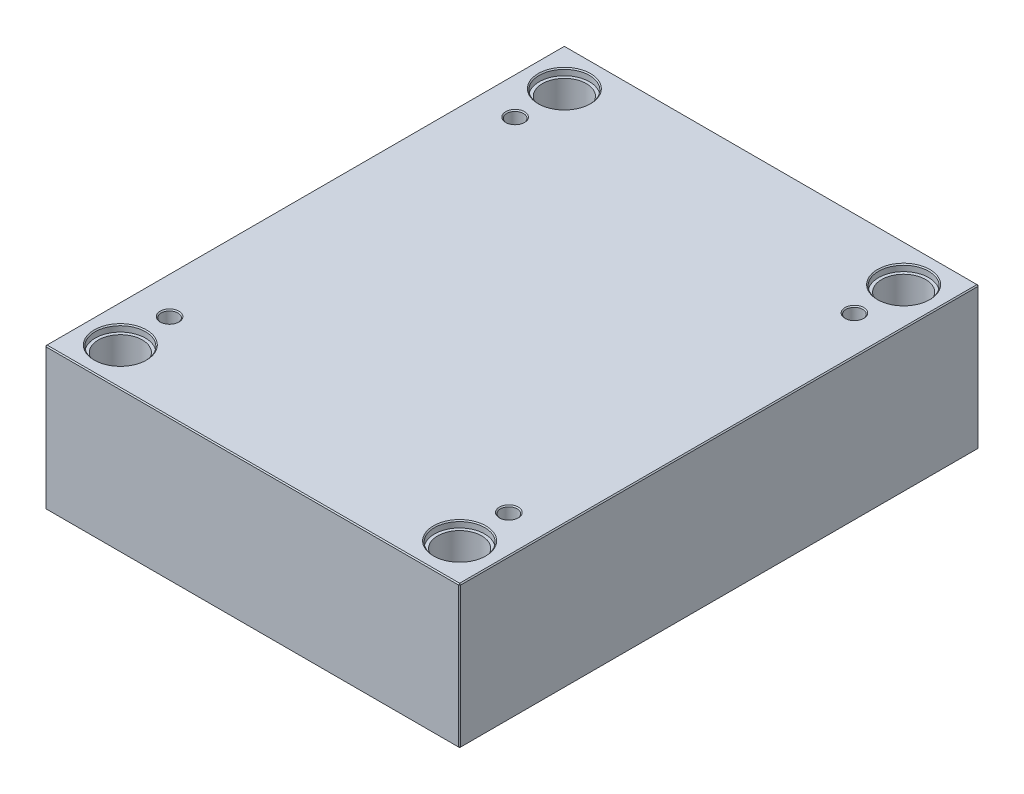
ISO-10303-21;
HEADER;
FILE_DESCRIPTION(('STEP AP214'),'2;1');
FILE_NAME('part.step','',(''),(''),'','','');
FILE_SCHEMA(('AUTOMOTIVE_DESIGN { 1 0 10303 214 1 1 1 1 }'));
ENDSEC;
DATA;
#1=APPLICATION_CONTEXT('core data for automotive mechanical design processes');
#2=APPLICATION_PROTOCOL_DEFINITION('international standard','automotive_design',2000,#1);
#3=PRODUCT_CONTEXT('',#1,'mechanical');
#4=PRODUCT('Part','Part','',(#3));
#5=PRODUCT_RELATED_PRODUCT_CATEGORY('part','',(#4));
#6=PRODUCT_DEFINITION_FORMATION('','',#4);
#7=PRODUCT_DEFINITION_CONTEXT('part definition',#1,'design');
#8=PRODUCT_DEFINITION('design','',#6,#7);
#9=PRODUCT_DEFINITION_SHAPE('','',#8);
#10=(LENGTH_UNIT() NAMED_UNIT(*) SI_UNIT(.MILLI.,.METRE.));
#11=(NAMED_UNIT(*) PLANE_ANGLE_UNIT() SI_UNIT($,.RADIAN.));
#12=(NAMED_UNIT(*) SI_UNIT($,.STERADIAN.) SOLID_ANGLE_UNIT());
#13=UNCERTAINTY_MEASURE_WITH_UNIT(LENGTH_MEASURE(1.E-05),#10,'distance_accuracy_value','');
#14=(GEOMETRIC_REPRESENTATION_CONTEXT(3) GLOBAL_UNCERTAINTY_ASSIGNED_CONTEXT((#13)) GLOBAL_UNIT_ASSIGNED_CONTEXT((#10,
#11,#12)) REPRESENTATION_CONTEXT('',''));
#15=CARTESIAN_POINT('',(0.,0.,0.));
#16=DIRECTION('',(0.,0.,1.));
#17=DIRECTION('',(1.,0.,0.));
#18=AXIS2_PLACEMENT_3D('',#15,#16,#17);
#19=CARTESIAN_POINT('',(-162.,0.,-212.));
#20=DIRECTION('',(0.,1.,0.));
#21=DIRECTION('',(0.,0.,1.));
#22=AXIS2_PLACEMENT_3D('',#19,#20,#21);
#23=CYLINDRICAL_SURFACE('',#22,21.);
#24=CARTESIAN_POINT('',(-162.,1.00000000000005,-212.));
#25=DIRECTION('',(0.,1.,0.));
#26=DIRECTION('',(0.,0.,1.));
#27=AXIS2_PLACEMENT_3D('',#24,#25,#26);
#28=CIRCLE('',#27,21.);
#29=CARTESIAN_POINT('',(-162.,1.00000000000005,-191.));
#30=VERTEX_POINT('',#29);
#31=EDGE_CURVE('E472',#30,#30,#28,.F.);
#32=ORIENTED_EDGE('',*,*,#31,.T.);
#33=EDGE_LOOP('',(#32));
#34=FACE_BOUND('',#33,.T.);
#35=CARTESIAN_POINT('',(-162.,129.7,-212.));
#36=DIRECTION('',(0.,1.,0.));
#37=DIRECTION('',(0.,0.,1.));
#38=AXIS2_PLACEMENT_3D('',#35,#36,#37);
#39=CIRCLE('',#38,21.);
#40=CARTESIAN_POINT('',(-162.,129.7,-191.));
#41=VERTEX_POINT('',#40);
#42=EDGE_CURVE('E221',#41,#41,#39,.F.);
#43=ORIENTED_EDGE('',*,*,#42,.F.);
#44=EDGE_LOOP('',(#43));
#45=FACE_BOUND('',#44,.T.);
#46=ADVANCED_FACE('F16',(#34,#45),#23,.F.);
#47=CARTESIAN_POINT('',(162.,0.,-212.));
#48=DIRECTION('',(0.,1.,0.));
#49=DIRECTION('',(0.,0.,1.));
#50=AXIS2_PLACEMENT_3D('',#47,#48,#49);
#51=CYLINDRICAL_SURFACE('',#50,21.);
#52=CARTESIAN_POINT('',(162.,1.00000000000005,-212.));
#53=DIRECTION('',(0.,1.,0.));
#54=DIRECTION('',(0.,0.,1.));
#55=AXIS2_PLACEMENT_3D('',#52,#53,#54);
#56=CIRCLE('',#55,21.);
#57=CARTESIAN_POINT('',(162.,1.00000000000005,-191.));
#58=VERTEX_POINT('',#57);
#59=EDGE_CURVE('E474',#58,#58,#56,.F.);
#60=ORIENTED_EDGE('',*,*,#59,.T.);
#61=EDGE_LOOP('',(#60));
#62=FACE_BOUND('',#61,.T.);
#63=CARTESIAN_POINT('',(162.,129.7,-212.));
#64=DIRECTION('',(0.,1.,0.));
#65=DIRECTION('',(0.,0.,1.));
#66=AXIS2_PLACEMENT_3D('',#63,#64,#65);
#67=CIRCLE('',#66,21.);
#68=CARTESIAN_POINT('',(162.,129.7,-191.));
#69=VERTEX_POINT('',#68);
#70=EDGE_CURVE('E218',#69,#69,#67,.F.);
#71=ORIENTED_EDGE('',*,*,#70,.F.);
#72=EDGE_LOOP('',(#71));
#73=FACE_BOUND('',#72,.T.);
#74=ADVANCED_FACE('F263',(#62,#73),#51,.F.);
#75=CARTESIAN_POINT('',(162.,0.,212.));
#76=DIRECTION('',(0.,1.,0.));
#77=DIRECTION('',(0.,0.,1.));
#78=AXIS2_PLACEMENT_3D('',#75,#76,#77);
#79=CYLINDRICAL_SURFACE('',#78,21.);
#80=CARTESIAN_POINT('',(162.,0.999999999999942,212.));
#81=DIRECTION('',(0.,1.,0.));
#82=DIRECTION('',(0.,0.,1.));
#83=AXIS2_PLACEMENT_3D('',#80,#81,#82);
#84=CIRCLE('',#83,21.);
#85=CARTESIAN_POINT('',(162.,0.999999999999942,233.));
#86=VERTEX_POINT('',#85);
#87=EDGE_CURVE('E477',#86,#86,#84,.F.);
#88=ORIENTED_EDGE('',*,*,#87,.T.);
#89=EDGE_LOOP('',(#88));
#90=FACE_BOUND('',#89,.T.);
#91=CARTESIAN_POINT('',(162.,129.7,212.));
#92=DIRECTION('',(0.,1.,0.));
#93=DIRECTION('',(0.,0.,1.));
#94=AXIS2_PLACEMENT_3D('',#91,#92,#93);
#95=CIRCLE('',#94,21.);
#96=CARTESIAN_POINT('',(162.,129.7,233.));
#97=VERTEX_POINT('',#96);
#98=EDGE_CURVE('E214',#97,#97,#95,.F.);
#99=ORIENTED_EDGE('',*,*,#98,.F.);
#100=EDGE_LOOP('',(#99));
#101=FACE_BOUND('',#100,.T.);
#102=ADVANCED_FACE('F270',(#90,#101),#79,.F.);
#103=CARTESIAN_POINT('',(-162.,0.,212.));
#104=DIRECTION('',(0.,1.,0.));
#105=DIRECTION('',(0.,0.,1.));
#106=AXIS2_PLACEMENT_3D('',#103,#104,#105);
#107=CYLINDRICAL_SURFACE('',#106,21.);
#108=CARTESIAN_POINT('',(-162.,1.00000000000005,212.));
#109=DIRECTION('',(0.,1.,0.));
#110=DIRECTION('',(0.,0.,1.));
#111=AXIS2_PLACEMENT_3D('',#108,#109,#110);
#112=CIRCLE('',#111,21.);
#113=CARTESIAN_POINT('',(-162.,1.00000000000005,233.));
#114=VERTEX_POINT('',#113);
#115=EDGE_CURVE('E480',#114,#114,#112,.F.);
#116=ORIENTED_EDGE('',*,*,#115,.T.);
#117=EDGE_LOOP('',(#116));
#118=FACE_BOUND('',#117,.T.);
#119=CARTESIAN_POINT('',(-162.,129.7,212.));
#120=DIRECTION('',(0.,1.,0.));
#121=DIRECTION('',(0.,0.,1.));
#122=AXIS2_PLACEMENT_3D('',#119,#120,#121);
#123=CIRCLE('',#122,21.);
#124=CARTESIAN_POINT('',(-162.,129.7,233.));
#125=VERTEX_POINT('',#124);
#126=EDGE_CURVE('E211',#125,#125,#123,.F.);
#127=ORIENTED_EDGE('',*,*,#126,.F.);
#128=EDGE_LOOP('',(#127));
#129=FACE_BOUND('',#128,.T.);
#130=ADVANCED_FACE('F277',(#118,#129),#107,.F.);
#131=CARTESIAN_POINT('',(-198.,136.,248.));
#132=DIRECTION('',(1.,0.,0.));
#133=DIRECTION('',(0.,0.,-1.));
#134=AXIS2_PLACEMENT_3D('',#131,#132,#133);
#135=PLANE('',#134);
#136=DIRECTION('',(0.,-1.,0.));
#137=VECTOR('',#136,1.);
#138=CARTESIAN_POINT('',(-198.,136.,-247.));
#139=LINE('',#138,#137);
#140=CARTESIAN_POINT('',(-198.,135.,-247.));
#141=VERTEX_POINT('',#140);
#142=CARTESIAN_POINT('',(-198.,1.00000000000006,-247.));
#143=VERTEX_POINT('',#142);
#144=EDGE_CURVE('E487',#141,#143,#139,.T.);
#145=ORIENTED_EDGE('',*,*,#144,.T.);
#146=DIRECTION('',(0.,0.,1.));
#147=VECTOR('',#146,1.);
#148=CARTESIAN_POINT('',(-198.,1.00000000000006,248.));
#149=LINE('',#148,#147);
#150=CARTESIAN_POINT('',(-198.,1.00000000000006,247.));
#151=VERTEX_POINT('',#150);
#152=EDGE_CURVE('E490',#143,#151,#149,.T.);
#153=ORIENTED_EDGE('',*,*,#152,.T.);
#154=DIRECTION('',(0.,1.,0.));
#155=VECTOR('',#154,1.);
#156=CARTESIAN_POINT('',(-198.,136.,247.));
#157=LINE('',#156,#155);
#158=CARTESIAN_POINT('',(-198.,135.,247.));
#159=VERTEX_POINT('',#158);
#160=EDGE_CURVE('E485',#151,#159,#157,.T.);
#161=ORIENTED_EDGE('',*,*,#160,.T.);
#162=DIRECTION('',(0.,0.,-1.));
#163=VECTOR('',#162,1.);
#164=CARTESIAN_POINT('',(-198.,135.,-248.));
#165=LINE('',#164,#163);
#166=EDGE_CURVE('E483',#159,#141,#165,.T.);
#167=ORIENTED_EDGE('',*,*,#166,.T.);
#168=EDGE_LOOP('',(#145,#153,#161,#167));
#169=FACE_BOUND('',#168,.T.);
#170=ADVANCED_FACE('F298',(#169),#135,.F.);
#171=CARTESIAN_POINT('',(198.,136.,248.));
#172=DIRECTION('',(0.,0.,-1.));
#173=DIRECTION('',(-1.,0.,0.));
#174=AXIS2_PLACEMENT_3D('',#171,#172,#173);
#175=PLANE('',#174);
#176=DIRECTION('',(-1.,0.,0.));
#177=VECTOR('',#176,1.);
#178=CARTESIAN_POINT('',(-198.,135.,248.));
#179=LINE('',#178,#177);
#180=CARTESIAN_POINT('',(197.,135.,248.));
#181=VERTEX_POINT('',#180);
#182=CARTESIAN_POINT('',(-197.,135.,248.));
#183=VERTEX_POINT('',#182);
#184=EDGE_CURVE('E509',#181,#183,#179,.T.);
#185=ORIENTED_EDGE('',*,*,#184,.T.);
#186=DIRECTION('',(0.,-1.,0.));
#187=VECTOR('',#186,1.);
#188=CARTESIAN_POINT('',(-197.,136.,248.));
#189=LINE('',#188,#187);
#190=CARTESIAN_POINT('',(-197.,1.,248.));
#191=VERTEX_POINT('',#190);
#192=EDGE_CURVE('E515',#183,#191,#189,.T.);
#193=ORIENTED_EDGE('',*,*,#192,.T.);
#194=DIRECTION('',(1.,0.,0.));
#195=VECTOR('',#194,1.);
#196=CARTESIAN_POINT('',(198.,1.,248.));
#197=LINE('',#196,#195);
#198=CARTESIAN_POINT('',(197.,1.,248.));
#199=VERTEX_POINT('',#198);
#200=EDGE_CURVE('E513',#191,#199,#197,.T.);
#201=ORIENTED_EDGE('',*,*,#200,.T.);
#202=DIRECTION('',(0.,1.,0.));
#203=VECTOR('',#202,1.);
#204=CARTESIAN_POINT('',(197.,136.,248.));
#205=LINE('',#204,#203);
#206=EDGE_CURVE('E511',#199,#181,#205,.T.);
#207=ORIENTED_EDGE('',*,*,#206,.T.);
#208=EDGE_LOOP('',(#185,#193,#201,#207));
#209=FACE_BOUND('',#208,.T.);
#210=ADVANCED_FACE('F294',(#209),#175,.F.);
#211=CARTESIAN_POINT('',(198.,136.,248.));
#212=DIRECTION('',(-1.,0.,0.));
#213=DIRECTION('',(0.,0.,1.));
#214=AXIS2_PLACEMENT_3D('',#211,#212,#213);
#215=PLANE('',#214);
#216=DIRECTION('',(0.,0.,-1.));
#217=VECTOR('',#216,1.);
#218=CARTESIAN_POINT('',(198.,1.,248.));
#219=LINE('',#218,#217);
#220=CARTESIAN_POINT('',(198.,1.,247.));
#221=VERTEX_POINT('',#220);
#222=CARTESIAN_POINT('',(198.,1.,-247.));
#223=VERTEX_POINT('',#222);
#224=EDGE_CURVE('E504',#221,#223,#219,.T.);
#225=ORIENTED_EDGE('',*,*,#224,.T.);
#226=DIRECTION('',(0.,1.,0.));
#227=VECTOR('',#226,1.);
#228=CARTESIAN_POINT('',(198.,136.,-247.));
#229=LINE('',#228,#227);
#230=CARTESIAN_POINT('',(198.,135.,-247.));
#231=VERTEX_POINT('',#230);
#232=EDGE_CURVE('E506',#223,#231,#229,.T.);
#233=ORIENTED_EDGE('',*,*,#232,.T.);
#234=DIRECTION('',(0.,0.,1.));
#235=VECTOR('',#234,1.);
#236=CARTESIAN_POINT('',(198.,135.,248.));
#237=LINE('',#236,#235);
#238=CARTESIAN_POINT('',(198.,135.,247.));
#239=VERTEX_POINT('',#238);
#240=EDGE_CURVE('E500',#231,#239,#237,.T.);
#241=ORIENTED_EDGE('',*,*,#240,.T.);
#242=DIRECTION('',(0.,-1.,0.));
#243=VECTOR('',#242,1.);
#244=CARTESIAN_POINT('',(198.,136.,247.));
#245=LINE('',#244,#243);
#246=EDGE_CURVE('E502',#239,#221,#245,.T.);
#247=ORIENTED_EDGE('',*,*,#246,.T.);
#248=EDGE_LOOP('',(#225,#233,#241,#247));
#249=FACE_BOUND('',#248,.T.);
#250=ADVANCED_FACE('F290',(#249),#215,.F.);
#251=CARTESIAN_POINT('',(198.,136.,-248.));
#252=DIRECTION('',(0.,0.,1.));
#253=DIRECTION('',(1.,0.,0.));
#254=AXIS2_PLACEMENT_3D('',#251,#252,#253);
#255=PLANE('',#254);
#256=DIRECTION('',(0.,-1.,0.));
#257=VECTOR('',#256,1.);
#258=CARTESIAN_POINT('',(197.,136.,-248.));
#259=LINE('',#258,#257);
#260=CARTESIAN_POINT('',(197.,135.,-248.));
#261=VERTEX_POINT('',#260);
#262=CARTESIAN_POINT('',(197.,1.,-248.));
#263=VERTEX_POINT('',#262);
#264=EDGE_CURVE('E494',#261,#263,#259,.T.);
#265=ORIENTED_EDGE('',*,*,#264,.T.);
#266=DIRECTION('',(-1.,0.,0.));
#267=VECTOR('',#266,1.);
#268=CARTESIAN_POINT('',(198.,1.,-248.));
#269=LINE('',#268,#267);
#270=CARTESIAN_POINT('',(-197.,1.,-248.));
#271=VERTEX_POINT('',#270);
#272=EDGE_CURVE('E138',#263,#271,#269,.T.);
#273=ORIENTED_EDGE('',*,*,#272,.T.);
#274=DIRECTION('',(0.,1.,0.));
#275=VECTOR('',#274,1.);
#276=CARTESIAN_POINT('',(-197.,136.,-248.));
#277=LINE('',#276,#275);
#278=CARTESIAN_POINT('',(-197.,135.,-248.));
#279=VERTEX_POINT('',#278);
#280=EDGE_CURVE('E496',#271,#279,#277,.T.);
#281=ORIENTED_EDGE('',*,*,#280,.T.);
#282=DIRECTION('',(1.,0.,0.));
#283=VECTOR('',#282,1.);
#284=CARTESIAN_POINT('',(198.,135.,-248.));
#285=LINE('',#284,#283);
#286=EDGE_CURVE('E492',#279,#261,#285,.T.);
#287=ORIENTED_EDGE('',*,*,#286,.T.);
#288=EDGE_LOOP('',(#265,#273,#281,#287));
#289=FACE_BOUND('',#288,.T.);
#290=ADVANCED_FACE('F282',(#289),#255,.F.);
#291=CARTESIAN_POINT('',(0.,136.,0.));
#292=DIRECTION('',(0.,1.,0.));
#293=DIRECTION('',(0.,0.,1.));
#294=AXIS2_PLACEMENT_3D('',#291,#292,#293);
#295=PLANE('',#294);
#296=CARTESIAN_POINT('',(162.,136.,212.));
#297=DIRECTION('',(0.,1.,0.));
#298=DIRECTION('',(0.,0.,1.));
#299=AXIS2_PLACEMENT_3D('',#296,#297,#298);
#300=CIRCLE('',#299,25.);
#301=CARTESIAN_POINT('',(162.,136.,237.));
#302=VERTEX_POINT('',#301);
#303=EDGE_CURVE('E236',#302,#302,#300,.F.);
#304=ORIENTED_EDGE('',*,*,#303,.T.);
#305=EDGE_LOOP('',(#304));
#306=FACE_BOUND('',#305,.T.);
#307=CARTESIAN_POINT('',(-162.,136.,212.));
#308=DIRECTION('',(0.,1.,0.));
#309=DIRECTION('',(0.,0.,1.));
#310=AXIS2_PLACEMENT_3D('',#307,#308,#309);
#311=CIRCLE('',#310,25.);
#312=CARTESIAN_POINT('',(-162.,136.,237.));
#313=VERTEX_POINT('',#312);
#314=EDGE_CURVE('E233',#313,#313,#311,.F.);
#315=ORIENTED_EDGE('',*,*,#314,.T.);
#316=EDGE_LOOP('',(#315));
#317=FACE_BOUND('',#316,.T.);
#318=CARTESIAN_POINT('',(162.,136.,-212.));
#319=DIRECTION('',(0.,1.,0.));
#320=DIRECTION('',(0.,0.,1.));
#321=AXIS2_PLACEMENT_3D('',#318,#319,#320);
#322=CIRCLE('',#321,25.);
#323=CARTESIAN_POINT('',(162.,136.,-187.));
#324=VERTEX_POINT('',#323);
#325=EDGE_CURVE('E230',#324,#324,#322,.F.);
#326=ORIENTED_EDGE('',*,*,#325,.T.);
#327=EDGE_LOOP('',(#326));
#328=FACE_BOUND('',#327,.T.);
#329=CARTESIAN_POINT('',(-162.,136.,-212.));
#330=DIRECTION('',(0.,1.,0.));
#331=DIRECTION('',(0.,0.,1.));
#332=AXIS2_PLACEMENT_3D('',#329,#330,#331);
#333=CIRCLE('',#332,25.);
#334=CARTESIAN_POINT('',(-162.,136.,-187.));
#335=VERTEX_POINT('',#334);
#336=EDGE_CURVE('E227',#335,#335,#333,.F.);
#337=ORIENTED_EDGE('',*,*,#336,.T.);
#338=EDGE_LOOP('',(#337));
#339=FACE_BOUND('',#338,.T.);
#340=CARTESIAN_POINT('',(-162.,136.,165.));
#341=DIRECTION('',(0.,1.,0.));
#342=DIRECTION('',(0.,0.,1.));
#343=AXIS2_PLACEMENT_3D('',#340,#341,#342);
#344=CIRCLE('',#343,9.);
#345=CARTESIAN_POINT('',(-162.,136.,174.));
#346=VERTEX_POINT('',#345);
#347=EDGE_CURVE('E198',#346,#346,#344,.F.);
#348=ORIENTED_EDGE('',*,*,#347,.T.);
#349=EDGE_LOOP('',(#348));
#350=FACE_BOUND('',#349,.T.);
#351=CARTESIAN_POINT('',(162.,136.,165.));
#352=DIRECTION('',(0.,1.,0.));
#353=DIRECTION('',(0.,0.,1.));
#354=AXIS2_PLACEMENT_3D('',#351,#352,#353);
#355=CIRCLE('',#354,9.);
#356=CARTESIAN_POINT('',(162.,136.,174.));
#357=VERTEX_POINT('',#356);
#358=EDGE_CURVE('E195',#357,#357,#355,.F.);
#359=ORIENTED_EDGE('',*,*,#358,.T.);
#360=EDGE_LOOP('',(#359));
#361=FACE_BOUND('',#360,.T.);
#362=CARTESIAN_POINT('',(162.,136.,-165.));
#363=DIRECTION('',(0.,1.,0.));
#364=DIRECTION('',(0.,0.,1.));
#365=AXIS2_PLACEMENT_3D('',#362,#363,#364);
#366=CIRCLE('',#365,9.);
#367=CARTESIAN_POINT('',(162.,136.,-156.));
#368=VERTEX_POINT('',#367);
#369=EDGE_CURVE('E192',#368,#368,#366,.F.);
#370=ORIENTED_EDGE('',*,*,#369,.T.);
#371=EDGE_LOOP('',(#370));
#372=FACE_BOUND('',#371,.T.);
#373=CARTESIAN_POINT('',(-162.,136.,-165.));
#374=DIRECTION('',(0.,1.,0.));
#375=DIRECTION('',(0.,0.,1.));
#376=AXIS2_PLACEMENT_3D('',#373,#374,#375);
#377=CIRCLE('',#376,9.);
#378=CARTESIAN_POINT('',(-162.,136.,-156.));
#379=VERTEX_POINT('',#378);
#380=EDGE_CURVE('E188',#379,#379,#377,.F.);
#381=ORIENTED_EDGE('',*,*,#380,.T.);
#382=EDGE_LOOP('',(#381));
#383=FACE_BOUND('',#382,.T.);
#384=DIRECTION('',(0.,0.,-1.));
#385=VECTOR('',#384,1.);
#386=CARTESIAN_POINT('',(197.,136.,-248.));
#387=LINE('',#386,#385);
#388=CARTESIAN_POINT('',(197.,136.,247.));
#389=VERTEX_POINT('',#388);
#390=CARTESIAN_POINT('',(197.,136.,-247.));
#391=VERTEX_POINT('',#390);
#392=EDGE_CURVE('E31',#389,#391,#387,.T.);
#393=ORIENTED_EDGE('',*,*,#392,.T.);
#394=DIRECTION('',(-1.,0.,0.));
#395=VECTOR('',#394,1.);
#396=CARTESIAN_POINT('',(-198.,136.,-247.));
#397=LINE('',#396,#395);
#398=CARTESIAN_POINT('',(-197.,136.,-247.));
#399=VERTEX_POINT('',#398);
#400=EDGE_CURVE('E189',#391,#399,#397,.T.);
#401=ORIENTED_EDGE('',*,*,#400,.T.);
#402=DIRECTION('',(0.,0.,1.));
#403=VECTOR('',#402,1.);
#404=CARTESIAN_POINT('',(-197.,136.,248.));
#405=LINE('',#404,#403);
#406=CARTESIAN_POINT('',(-197.,136.,247.));
#407=VERTEX_POINT('',#406);
#408=EDGE_CURVE('E518',#399,#407,#405,.T.);
#409=ORIENTED_EDGE('',*,*,#408,.T.);
#410=DIRECTION('',(1.,0.,0.));
#411=VECTOR('',#410,1.);
#412=CARTESIAN_POINT('',(198.,136.,247.));
#413=LINE('',#412,#411);
#414=EDGE_CURVE('E36',#407,#389,#413,.T.);
#415=ORIENTED_EDGE('',*,*,#414,.T.);
#416=EDGE_LOOP('',(#393,#401,#409,#415));
#417=FACE_BOUND('',#416,.T.);
#418=ADVANCED_FACE('F279',(#306,#317,#328,#339,#350,#361,#372,#383,#417),#295,.T.);
#419=CARTESIAN_POINT('',(0.,0.,0.));
#420=DIRECTION('',(0.,1.,0.));
#421=DIRECTION('',(0.,0.,1.));
#422=AXIS2_PLACEMENT_3D('',#419,#420,#421);
#423=PLANE('',#422);
#424=CARTESIAN_POINT('',(-162.,0.,-212.));
#425=DIRECTION('',(0.,1.,0.));
#426=DIRECTION('',(0.,0.,1.));
#427=AXIS2_PLACEMENT_3D('',#424,#425,#426);
#428=CIRCLE('',#427,22.);
#429=CARTESIAN_POINT('',(-162.,0.,-190.));
#430=VERTEX_POINT('',#429);
#431=EDGE_CURVE('E469',#430,#430,#428,.T.);
#432=ORIENTED_EDGE('',*,*,#431,.T.);
#433=EDGE_LOOP('',(#432));
#434=FACE_BOUND('',#433,.T.);
#435=CARTESIAN_POINT('',(162.,0.,-212.));
#436=DIRECTION('',(0.,1.,0.));
#437=DIRECTION('',(0.,0.,1.));
#438=AXIS2_PLACEMENT_3D('',#435,#436,#437);
#439=CIRCLE('',#438,22.);
#440=CARTESIAN_POINT('',(162.,0.,-190.));
#441=VERTEX_POINT('',#440);
#442=EDGE_CURVE('E466',#441,#441,#439,.T.);
#443=ORIENTED_EDGE('',*,*,#442,.T.);
#444=EDGE_LOOP('',(#443));
#445=FACE_BOUND('',#444,.T.);
#446=CARTESIAN_POINT('',(162.,0.,212.));
#447=DIRECTION('',(0.,1.,0.));
#448=DIRECTION('',(0.,0.,1.));
#449=AXIS2_PLACEMENT_3D('',#446,#447,#448);
#450=CIRCLE('',#449,22.);
#451=CARTESIAN_POINT('',(162.,0.,234.));
#452=VERTEX_POINT('',#451);
#453=EDGE_CURVE('E463',#452,#452,#450,.T.);
#454=ORIENTED_EDGE('',*,*,#453,.T.);
#455=EDGE_LOOP('',(#454));
#456=FACE_BOUND('',#455,.T.);
#457=CARTESIAN_POINT('',(-162.,0.,212.));
#458=DIRECTION('',(0.,1.,0.));
#459=DIRECTION('',(0.,0.,1.));
#460=AXIS2_PLACEMENT_3D('',#457,#458,#459);
#461=CIRCLE('',#460,22.);
#462=CARTESIAN_POINT('',(-162.,0.,234.));
#463=VERTEX_POINT('',#462);
#464=EDGE_CURVE('E460',#463,#463,#461,.T.);
#465=ORIENTED_EDGE('',*,*,#464,.T.);
#466=EDGE_LOOP('',(#465));
#467=FACE_BOUND('',#466,.T.);
#468=DIRECTION('',(0.,0.,1.));
#469=VECTOR('',#468,1.);
#470=CARTESIAN_POINT('',(197.,0.,0.));
#471=LINE('',#470,#469);
#472=CARTESIAN_POINT('',(197.,0.,-247.));
#473=VERTEX_POINT('',#472);
#474=CARTESIAN_POINT('',(197.,0.,247.));
#475=VERTEX_POINT('',#474);
#476=EDGE_CURVE('E108',#473,#475,#471,.T.);
#477=ORIENTED_EDGE('',*,*,#476,.T.);
#478=DIRECTION('',(-1.,0.,0.));
#479=VECTOR('',#478,1.);
#480=CARTESIAN_POINT('',(0.,0.,247.));
#481=LINE('',#480,#479);
#482=CARTESIAN_POINT('',(-197.,0.,247.));
#483=VERTEX_POINT('',#482);
#484=EDGE_CURVE('E458',#475,#483,#481,.T.);
#485=ORIENTED_EDGE('',*,*,#484,.T.);
#486=DIRECTION('',(0.,0.,-1.));
#487=VECTOR('',#486,1.);
#488=CARTESIAN_POINT('',(-197.,0.,0.));
#489=LINE('',#488,#487);
#490=CARTESIAN_POINT('',(-197.,0.,-247.));
#491=VERTEX_POINT('',#490);
#492=EDGE_CURVE('E110',#483,#491,#489,.T.);
#493=ORIENTED_EDGE('',*,*,#492,.T.);
#494=DIRECTION('',(1.,0.,0.));
#495=VECTOR('',#494,1.);
#496=CARTESIAN_POINT('',(0.,0.,-247.));
#497=LINE('',#496,#495);
#498=EDGE_CURVE('E104',#491,#473,#497,.T.);
#499=ORIENTED_EDGE('',*,*,#498,.T.);
#500=EDGE_LOOP('',(#477,#485,#493,#499));
#501=FACE_BOUND('',#500,.T.);
#502=ADVANCED_FACE('F106',(#434,#445,#456,#467,#501),#423,.F.);
#503=CARTESIAN_POINT('',(-162.,0.,-212.));
#504=DIRECTION('',(0.,-1.,0.));
#505=DIRECTION('',(0.,0.,-1.));
#506=AXIS2_PLACEMENT_3D('',#503,#504,#505);
#507=CONICAL_SURFACE('',#506,22.,0.785398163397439);
#508=ORIENTED_EDGE('',*,*,#31,.F.);
#509=EDGE_LOOP('',(#508));
#510=FACE_BOUND('',#509,.T.);
#511=ORIENTED_EDGE('',*,*,#431,.F.);
#512=EDGE_LOOP('',(#511));
#513=FACE_BOUND('',#512,.T.);
#514=ADVANCED_FACE('F286',(#510,#513),#507,.F.);
#515=CARTESIAN_POINT('',(162.,0.,-212.));
#516=DIRECTION('',(0.,-1.,0.));
#517=DIRECTION('',(0.,0.,-1.));
#518=AXIS2_PLACEMENT_3D('',#515,#516,#517);
#519=CONICAL_SURFACE('',#518,22.,0.785398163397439);
#520=ORIENTED_EDGE('',*,*,#59,.F.);
#521=EDGE_LOOP('',(#520));
#522=FACE_BOUND('',#521,.T.);
#523=ORIENTED_EDGE('',*,*,#442,.F.);
#524=EDGE_LOOP('',(#523));
#525=FACE_BOUND('',#524,.T.);
#526=ADVANCED_FACE('F305',(#522,#525),#519,.F.);
#527=CARTESIAN_POINT('',(162.,0.,212.));
#528=DIRECTION('',(0.,-1.,0.));
#529=DIRECTION('',(0.,0.,-1.));
#530=AXIS2_PLACEMENT_3D('',#527,#528,#529);
#531=CONICAL_SURFACE('',#530,22.,0.785398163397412);
#532=ORIENTED_EDGE('',*,*,#87,.F.);
#533=EDGE_LOOP('',(#532));
#534=FACE_BOUND('',#533,.T.);
#535=ORIENTED_EDGE('',*,*,#453,.F.);
#536=EDGE_LOOP('',(#535));
#537=FACE_BOUND('',#536,.T.);
#538=ADVANCED_FACE('F309',(#534,#537),#531,.F.);
#539=CARTESIAN_POINT('',(-162.,0.,212.));
#540=DIRECTION('',(0.,-1.,0.));
#541=DIRECTION('',(0.,0.,-1.));
#542=AXIS2_PLACEMENT_3D('',#539,#540,#541);
#543=CONICAL_SURFACE('',#542,22.,0.785398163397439);
#544=ORIENTED_EDGE('',*,*,#115,.F.);
#545=EDGE_LOOP('',(#544));
#546=FACE_BOUND('',#545,.T.);
#547=ORIENTED_EDGE('',*,*,#464,.F.);
#548=EDGE_LOOP('',(#547));
#549=FACE_BOUND('',#548,.T.);
#550=ADVANCED_FACE('F313',(#546,#549),#543,.F.);
#551=CARTESIAN_POINT('',(198.,136.,247.));
#552=DIRECTION('',(-0.707106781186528,0.,-0.707106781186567));
#553=DIRECTION('',(0.,-1.,0.));
#554=AXIS2_PLACEMENT_3D('',#551,#552,#553);
#555=PLANE('',#554);
#556=DIRECTION('',(-0.707106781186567,0.,0.707106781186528));
#557=VECTOR('',#556,1.);
#558=CARTESIAN_POINT('',(197.,135.,248.));
#559=LINE('',#558,#557);
#560=EDGE_CURVE('E126',#181,#239,#559,.F.);
#561=ORIENTED_EDGE('',*,*,#560,.F.);
#562=ORIENTED_EDGE('',*,*,#206,.F.);
#563=DIRECTION('',(0.707106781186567,0.,-0.707106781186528));
#564=VECTOR('',#563,1.);
#565=CARTESIAN_POINT('',(197.,1.,248.));
#566=LINE('',#565,#564);
#567=EDGE_CURVE('E180',#221,#199,#566,.F.);
#568=ORIENTED_EDGE('',*,*,#567,.F.);
#569=ORIENTED_EDGE('',*,*,#246,.F.);
#570=EDGE_LOOP('',(#561,#562,#568,#569));
#571=FACE_BOUND('',#570,.T.);
#572=ADVANCED_FACE('F317',(#571),#555,.F.);
#573=CARTESIAN_POINT('',(197.,135.,248.));
#574=DIRECTION('',(0.577350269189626,0.577350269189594,0.577350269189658));
#575=DIRECTION('',(0.707106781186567,0.,-0.707106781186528));
#576=AXIS2_PLACEMENT_3D('',#573,#574,#575);
#577=PLANE('',#576);
#578=DIRECTION('',(0.,-0.707106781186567,0.707106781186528));
#579=VECTOR('',#578,1.);
#580=CARTESIAN_POINT('',(197.,135.,248.));
#581=LINE('',#580,#579);
#582=EDGE_CURVE('E175',#181,#389,#581,.F.);
#583=ORIENTED_EDGE('',*,*,#582,.F.);
#584=ORIENTED_EDGE('',*,*,#560,.T.);
#585=DIRECTION('',(-0.707106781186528,0.707106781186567,0.));
#586=VECTOR('',#585,1.);
#587=CARTESIAN_POINT('',(197.5,135.5,247.));
#588=LINE('',#587,#586);
#589=EDGE_CURVE('E177',#389,#239,#588,.F.);
#590=ORIENTED_EDGE('',*,*,#589,.F.);
#591=EDGE_LOOP('',(#583,#584,#590));
#592=FACE_BOUND('',#591,.T.);
#593=ADVANCED_FACE('F385',(#592),#577,.T.);
#594=CARTESIAN_POINT('',(197.,1.,248.));
#595=DIRECTION('',(0.577350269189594,-0.577350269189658,0.577350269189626));
#596=DIRECTION('',(0.,-0.707106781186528,-0.707106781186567));
#597=AXIS2_PLACEMENT_3D('',#594,#595,#596);
#598=PLANE('',#597);
#599=DIRECTION('',(-0.707106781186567,-0.707106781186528,0.));
#600=VECTOR('',#599,1.);
#601=CARTESIAN_POINT('',(197.5,0.5,247.));
#602=LINE('',#601,#600);
#603=EDGE_CURVE('E124',#221,#475,#602,.T.);
#604=ORIENTED_EDGE('',*,*,#603,.F.);
#605=ORIENTED_EDGE('',*,*,#567,.T.);
#606=DIRECTION('',(0.,0.707106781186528,0.707106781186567));
#607=VECTOR('',#606,1.);
#608=CARTESIAN_POINT('',(197.,1.,248.));
#609=LINE('',#608,#607);
#610=EDGE_CURVE('E172',#475,#199,#609,.T.);
#611=ORIENTED_EDGE('',*,*,#610,.F.);
#612=EDGE_LOOP('',(#604,#605,#611));
#613=FACE_BOUND('',#612,.T.);
#614=ADVANCED_FACE('F381',(#613),#598,.T.);
#615=CARTESIAN_POINT('',(197.,136.,0.));
#616=DIRECTION('',(0.707106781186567,0.707106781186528,0.));
#617=DIRECTION('',(0.,0.,1.));
#618=AXIS2_PLACEMENT_3D('',#615,#616,#617);
#619=PLANE('',#618);
#620=ORIENTED_EDGE('',*,*,#589,.T.);
#621=ORIENTED_EDGE('',*,*,#240,.F.);
#622=DIRECTION('',(0.707106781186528,-0.707106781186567,0.));
#623=VECTOR('',#622,1.);
#624=CARTESIAN_POINT('',(198.,135.,-247.));
#625=LINE('',#624,#623);
#626=EDGE_CURVE('E166',#391,#231,#625,.T.);
#627=ORIENTED_EDGE('',*,*,#626,.F.);
#628=ORIENTED_EDGE('',*,*,#392,.F.);
#629=EDGE_LOOP('',(#620,#621,#627,#628));
#630=FACE_BOUND('',#629,.T.);
#631=ADVANCED_FACE('F377',(#630),#619,.T.);
#632=CARTESIAN_POINT('',(0.,136.,247.));
#633=DIRECTION('',(0.,0.707106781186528,0.707106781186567));
#634=DIRECTION('',(-1.,0.,0.));
#635=AXIS2_PLACEMENT_3D('',#632,#633,#634);
#636=PLANE('',#635);
#637=ORIENTED_EDGE('',*,*,#582,.T.);
#638=ORIENTED_EDGE('',*,*,#414,.F.);
#639=DIRECTION('',(0.,0.707106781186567,-0.707106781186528));
#640=VECTOR('',#639,1.);
#641=CARTESIAN_POINT('',(-197.,135.5,247.5));
#642=LINE('',#641,#640);
#643=EDGE_CURVE('E163',#183,#407,#642,.T.);
#644=ORIENTED_EDGE('',*,*,#643,.F.);
#645=ORIENTED_EDGE('',*,*,#184,.F.);
#646=EDGE_LOOP('',(#637,#638,#644,#645));
#647=FACE_BOUND('',#646,.T.);
#648=ADVANCED_FACE('F373',(#647),#636,.T.);
#649=CARTESIAN_POINT('',(-197.,136.,248.));
#650=DIRECTION('',(0.707106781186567,0.,-0.707106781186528));
#651=DIRECTION('',(0.,-1.,0.));
#652=AXIS2_PLACEMENT_3D('',#649,#650,#651);
#653=PLANE('',#652);
#654=DIRECTION('',(0.707106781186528,0.,0.707106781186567));
#655=VECTOR('',#654,1.);
#656=CARTESIAN_POINT('',(-197.,1.,248.));
#657=LINE('',#656,#655);
#658=EDGE_CURVE('E157',#191,#151,#657,.F.);
#659=ORIENTED_EDGE('',*,*,#658,.F.);
#660=ORIENTED_EDGE('',*,*,#192,.F.);
#661=DIRECTION('',(-0.707106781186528,0.,-0.707106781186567));
#662=VECTOR('',#661,1.);
#663=CARTESIAN_POINT('',(-198.,135.,247.));
#664=LINE('',#663,#662);
#665=EDGE_CURVE('E160',#159,#183,#664,.F.);
#666=ORIENTED_EDGE('',*,*,#665,.F.);
#667=ORIENTED_EDGE('',*,*,#160,.F.);
#668=EDGE_LOOP('',(#659,#660,#666,#667));
#669=FACE_BOUND('',#668,.T.);
#670=ADVANCED_FACE('F369',(#669),#653,.F.);
#671=CARTESIAN_POINT('',(198.,1.,248.));
#672=DIRECTION('',(0.,0.707106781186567,-0.707106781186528));
#673=DIRECTION('',(1.,0.,0.));
#674=AXIS2_PLACEMENT_3D('',#671,#672,#673);
#675=PLANE('',#674);
#676=ORIENTED_EDGE('',*,*,#610,.T.);
#677=ORIENTED_EDGE('',*,*,#200,.F.);
#678=DIRECTION('',(0.,-0.707106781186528,-0.707106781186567));
#679=VECTOR('',#678,1.);
#680=CARTESIAN_POINT('',(-197.,1.,248.));
#681=LINE('',#680,#679);
#682=EDGE_CURVE('E135',#483,#191,#681,.F.);
#683=ORIENTED_EDGE('',*,*,#682,.F.);
#684=ORIENTED_EDGE('',*,*,#484,.F.);
#685=EDGE_LOOP('',(#676,#677,#683,#684));
#686=FACE_BOUND('',#685,.T.);
#687=ADVANCED_FACE('F366',(#686),#675,.F.);
#688=CARTESIAN_POINT('',(198.,1.,248.));
#689=DIRECTION('',(-0.707106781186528,0.707106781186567,0.));
#690=DIRECTION('',(0.,0.,-1.));
#691=AXIS2_PLACEMENT_3D('',#688,#689,#690);
#692=PLANE('',#691);
#693=ORIENTED_EDGE('',*,*,#603,.T.);
#694=ORIENTED_EDGE('',*,*,#476,.F.);
#695=DIRECTION('',(0.707106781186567,0.707106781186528,0.));
#696=VECTOR('',#695,1.);
#697=CARTESIAN_POINT('',(197.5,0.499999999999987,-247.));
#698=LINE('',#697,#696);
#699=EDGE_CURVE('E121',#223,#473,#698,.F.);
#700=ORIENTED_EDGE('',*,*,#699,.F.);
#701=ORIENTED_EDGE('',*,*,#224,.F.);
#702=EDGE_LOOP('',(#693,#694,#700,#701));
#703=FACE_BOUND('',#702,.T.);
#704=ADVANCED_FACE('F119',(#703),#692,.F.);
#705=CARTESIAN_POINT('',(197.,136.,-248.));
#706=DIRECTION('',(-0.707106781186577,0.,0.707106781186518));
#707=DIRECTION('',(0.,-1.,0.));
#708=AXIS2_PLACEMENT_3D('',#705,#706,#707);
#709=PLANE('',#708);
#710=DIRECTION('',(0.707106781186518,0.,0.707106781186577));
#711=VECTOR('',#710,1.);
#712=CARTESIAN_POINT('',(198.,135.,-247.));
#713=LINE('',#712,#711);
#714=EDGE_CURVE('E168',#231,#261,#713,.F.);
#715=ORIENTED_EDGE('',*,*,#714,.F.);
#716=ORIENTED_EDGE('',*,*,#232,.F.);
#717=DIRECTION('',(-0.707106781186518,0.,-0.707106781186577));
#718=VECTOR('',#717,1.);
#719=CARTESIAN_POINT('',(197.,1.,-248.));
#720=LINE('',#719,#718);
#721=EDGE_CURVE('E134',#263,#223,#720,.F.);
#722=ORIENTED_EDGE('',*,*,#721,.F.);
#723=ORIENTED_EDGE('',*,*,#264,.F.);
#724=EDGE_LOOP('',(#715,#716,#722,#723));
#725=FACE_BOUND('',#724,.T.);
#726=ADVANCED_FACE('F359',(#725),#709,.F.);
#727=CARTESIAN_POINT('',(198.,135.,-247.));
#728=DIRECTION('',(0.577350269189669,0.577350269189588,-0.57735026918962));
#729=DIRECTION('',(-0.707106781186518,0.,-0.707106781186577));
#730=AXIS2_PLACEMENT_3D('',#727,#728,#729);
#731=PLANE('',#730);
#732=ORIENTED_EDGE('',*,*,#626,.T.);
#733=ORIENTED_EDGE('',*,*,#714,.T.);
#734=DIRECTION('',(0.,0.707106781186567,0.707106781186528));
#735=VECTOR('',#734,1.);
#736=CARTESIAN_POINT('',(197.,135.5,-247.5));
#737=LINE('',#736,#735);
#738=EDGE_CURVE('E152',#391,#261,#737,.F.);
#739=ORIENTED_EDGE('',*,*,#738,.F.);
#740=EDGE_LOOP('',(#732,#733,#739));
#741=FACE_BOUND('',#740,.T.);
#742=ADVANCED_FACE('F355',(#741),#731,.T.);
#743=CARTESIAN_POINT('',(-198.,135.,247.));
#744=DIRECTION('',(-0.577350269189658,0.577350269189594,0.577350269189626));
#745=DIRECTION('',(0.707106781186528,0.,0.707106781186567));
#746=AXIS2_PLACEMENT_3D('',#743,#744,#745);
#747=PLANE('',#746);
#748=ORIENTED_EDGE('',*,*,#665,.T.);
#749=ORIENTED_EDGE('',*,*,#643,.T.);
#750=DIRECTION('',(-0.707106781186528,-0.707106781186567,0.));
#751=VECTOR('',#750,1.);
#752=CARTESIAN_POINT('',(-198.,135.,247.));
#753=LINE('',#752,#751);
#754=EDGE_CURVE('E143',#159,#407,#753,.F.);
#755=ORIENTED_EDGE('',*,*,#754,.F.);
#756=EDGE_LOOP('',(#748,#749,#755));
#757=FACE_BOUND('',#756,.T.);
#758=ADVANCED_FACE('F351',(#757),#747,.T.);
#759=CARTESIAN_POINT('',(-197.,1.,248.));
#760=DIRECTION('',(-0.577350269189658,-0.577350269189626,0.577350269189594));
#761=DIRECTION('',(0.707106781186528,-0.707106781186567,0.));
#762=AXIS2_PLACEMENT_3D('',#759,#760,#761);
#763=PLANE('',#762);
#764=ORIENTED_EDGE('',*,*,#682,.T.);
#765=ORIENTED_EDGE('',*,*,#658,.T.);
#766=DIRECTION('',(-0.707106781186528,0.707106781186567,0.));
#767=VECTOR('',#766,1.);
#768=CARTESIAN_POINT('',(-197.5,0.500000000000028,247.));
#769=LINE('',#768,#767);
#770=EDGE_CURVE('E139',#483,#151,#769,.T.);
#771=ORIENTED_EDGE('',*,*,#770,.F.);
#772=EDGE_LOOP('',(#764,#765,#771));
#773=FACE_BOUND('',#772,.T.);
#774=ADVANCED_FACE('F348',(#773),#763,.T.);
#775=CARTESIAN_POINT('',(197.,1.,-248.));
#776=DIRECTION('',(0.577350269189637,-0.577350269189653,-0.577350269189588));
#777=DIRECTION('',(0.707106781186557,0.707106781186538,0.));
#778=AXIS2_PLACEMENT_3D('',#775,#776,#777);
#779=PLANE('',#778);
#780=ORIENTED_EDGE('',*,*,#721,.T.);
#781=ORIENTED_EDGE('',*,*,#699,.T.);
#782=DIRECTION('',(0.,-0.707106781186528,0.707106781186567));
#783=VECTOR('',#782,1.);
#784=CARTESIAN_POINT('',(197.,1.,-248.));
#785=LINE('',#784,#783);
#786=EDGE_CURVE('E131',#263,#473,#785,.T.);
#787=ORIENTED_EDGE('',*,*,#786,.F.);
#788=EDGE_LOOP('',(#780,#781,#787));
#789=FACE_BOUND('',#788,.T.);
#790=ADVANCED_FACE('F130',(#789),#779,.T.);
#791=CARTESIAN_POINT('',(0.,136.,-247.));
#792=DIRECTION('',(0.,0.707106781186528,-0.707106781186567));
#793=DIRECTION('',(1.,0.,0.));
#794=AXIS2_PLACEMENT_3D('',#791,#792,#793);
#795=PLANE('',#794);
#796=ORIENTED_EDGE('',*,*,#738,.T.);
#797=ORIENTED_EDGE('',*,*,#286,.F.);
#798=DIRECTION('',(0.,-0.707106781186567,-0.707106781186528));
#799=VECTOR('',#798,1.);
#800=CARTESIAN_POINT('',(-197.,135.,-248.));
#801=LINE('',#800,#799);
#802=EDGE_CURVE('E140',#399,#279,#801,.T.);
#803=ORIENTED_EDGE('',*,*,#802,.F.);
#804=ORIENTED_EDGE('',*,*,#400,.F.);
#805=EDGE_LOOP('',(#796,#797,#803,#804));
#806=FACE_BOUND('',#805,.T.);
#807=ADVANCED_FACE('F341',(#806),#795,.T.);
#808=CARTESIAN_POINT('',(-197.,136.,0.));
#809=DIRECTION('',(-0.707106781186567,0.707106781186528,0.));
#810=DIRECTION('',(0.,0.,-1.));
#811=AXIS2_PLACEMENT_3D('',#808,#809,#810);
#812=PLANE('',#811);
#813=ORIENTED_EDGE('',*,*,#754,.T.);
#814=ORIENTED_EDGE('',*,*,#408,.F.);
#815=DIRECTION('',(0.707106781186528,0.707106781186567,0.));
#816=VECTOR('',#815,1.);
#817=CARTESIAN_POINT('',(-197.5,135.5,-247.));
#818=LINE('',#817,#816);
#819=EDGE_CURVE('E146',#141,#399,#818,.T.);
#820=ORIENTED_EDGE('',*,*,#819,.F.);
#821=ORIENTED_EDGE('',*,*,#166,.F.);
#822=EDGE_LOOP('',(#813,#814,#820,#821));
#823=FACE_BOUND('',#822,.T.);
#824=ADVANCED_FACE('F337',(#823),#812,.T.);
#825=CARTESIAN_POINT('',(-198.,1.00000000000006,248.));
#826=DIRECTION('',(0.707106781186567,0.707106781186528,0.));
#827=DIRECTION('',(0.,0.,1.));
#828=AXIS2_PLACEMENT_3D('',#825,#826,#827);
#829=PLANE('',#828);
#830=ORIENTED_EDGE('',*,*,#770,.T.);
#831=ORIENTED_EDGE('',*,*,#152,.F.);
#832=DIRECTION('',(0.707106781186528,-0.707106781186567,0.));
#833=VECTOR('',#832,1.);
#834=CARTESIAN_POINT('',(-198.,1.00000000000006,-247.));
#835=LINE('',#834,#833);
#836=EDGE_CURVE('E529',#491,#143,#835,.F.);
#837=ORIENTED_EDGE('',*,*,#836,.F.);
#838=ORIENTED_EDGE('',*,*,#492,.F.);
#839=EDGE_LOOP('',(#830,#831,#837,#838));
#840=FACE_BOUND('',#839,.T.);
#841=ADVANCED_FACE('F334',(#840),#829,.F.);
#842=CARTESIAN_POINT('',(198.,1.,-248.));
#843=DIRECTION('',(0.,0.707106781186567,0.707106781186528));
#844=DIRECTION('',(-1.,0.,0.));
#845=AXIS2_PLACEMENT_3D('',#842,#843,#844);
#846=PLANE('',#845);
#847=ORIENTED_EDGE('',*,*,#786,.T.);
#848=ORIENTED_EDGE('',*,*,#498,.F.);
#849=DIRECTION('',(0.,0.707106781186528,-0.707106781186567));
#850=VECTOR('',#849,1.);
#851=CARTESIAN_POINT('',(-197.,0.500000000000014,-247.5));
#852=LINE('',#851,#850);
#853=EDGE_CURVE('E526',#271,#491,#852,.F.);
#854=ORIENTED_EDGE('',*,*,#853,.F.);
#855=ORIENTED_EDGE('',*,*,#272,.F.);
#856=EDGE_LOOP('',(#847,#848,#854,#855));
#857=FACE_BOUND('',#856,.T.);
#858=ADVANCED_FACE('F137',(#857),#846,.F.);
#859=CARTESIAN_POINT('',(-197.,135.,-248.));
#860=DIRECTION('',(-0.577350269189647,0.577350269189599,-0.577350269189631));
#861=DIRECTION('',(-0.707106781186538,0.,0.707106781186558));
#862=AXIS2_PLACEMENT_3D('',#859,#860,#861);
#863=PLANE('',#862);
#864=ORIENTED_EDGE('',*,*,#819,.T.);
#865=ORIENTED_EDGE('',*,*,#802,.T.);
#866=DIRECTION('',(0.707106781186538,0.,-0.707106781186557));
#867=VECTOR('',#866,1.);
#868=CARTESIAN_POINT('',(-197.,135.,-248.));
#869=LINE('',#868,#867);
#870=EDGE_CURVE('E524',#141,#279,#869,.T.);
#871=ORIENTED_EDGE('',*,*,#870,.F.);
#872=EDGE_LOOP('',(#864,#865,#871));
#873=FACE_BOUND('',#872,.T.);
#874=ADVANCED_FACE('F327',(#873),#863,.T.);
#875=CARTESIAN_POINT('',(-198.,1.00000000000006,-247.));
#876=DIRECTION('',(-0.577350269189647,-0.577350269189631,-0.577350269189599));
#877=DIRECTION('',(0.707106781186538,-0.707106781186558,0.));
#878=AXIS2_PLACEMENT_3D('',#875,#876,#877);
#879=PLANE('',#878);
#880=ORIENTED_EDGE('',*,*,#853,.T.);
#881=ORIENTED_EDGE('',*,*,#836,.T.);
#882=DIRECTION('',(-0.707106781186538,0.,0.707106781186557));
#883=VECTOR('',#882,1.);
#884=CARTESIAN_POINT('',(-198.,1.00000000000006,-247.));
#885=LINE('',#884,#883);
#886=EDGE_CURVE('E455',#271,#143,#885,.T.);
#887=ORIENTED_EDGE('',*,*,#886,.F.);
#888=EDGE_LOOP('',(#880,#881,#887));
#889=FACE_BOUND('',#888,.T.);
#890=ADVANCED_FACE('F323',(#889),#879,.T.);
#891=CARTESIAN_POINT('',(-198.,136.,-247.));
#892=DIRECTION('',(0.707106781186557,0.,0.707106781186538));
#893=DIRECTION('',(0.,-1.,0.));
#894=AXIS2_PLACEMENT_3D('',#891,#892,#893);
#895=PLANE('',#894);
#896=ORIENTED_EDGE('',*,*,#870,.T.);
#897=ORIENTED_EDGE('',*,*,#280,.F.);
#898=ORIENTED_EDGE('',*,*,#886,.T.);
#899=ORIENTED_EDGE('',*,*,#144,.F.);
#900=EDGE_LOOP('',(#896,#897,#898,#899));
#901=FACE_BOUND('',#900,.T.);
#902=ADVANCED_FACE('F319',(#901),#895,.F.);
#903=CARTESIAN_POINT('',(-162.,111.,-165.));
#904=DIRECTION('',(0.,1.,0.));
#905=DIRECTION('',(0.,0.,1.));
#906=AXIS2_PLACEMENT_3D('',#903,#904,#905);
#907=CYLINDRICAL_SURFACE('',#906,8.);
#908=CARTESIAN_POINT('',(-162.,135.,-165.));
#909=DIRECTION('',(0.,1.,0.));
#910=DIRECTION('',(0.,0.,1.));
#911=AXIS2_PLACEMENT_3D('',#908,#909,#910);
#912=CIRCLE('',#911,8.);
#913=CARTESIAN_POINT('',(-162.,135.,-157.));
#914=VERTEX_POINT('',#913);
#915=EDGE_CURVE('E207',#914,#914,#912,.T.);
#916=ORIENTED_EDGE('',*,*,#915,.T.);
#917=EDGE_LOOP('',(#916));
#918=FACE_BOUND('',#917,.T.);
#919=CARTESIAN_POINT('',(-162.,111.,-165.));
#920=DIRECTION('',(0.,1.,0.));
#921=DIRECTION('',(0.,0.,1.));
#922=AXIS2_PLACEMENT_3D('',#919,#920,#921);
#923=CIRCLE('',#922,8.);
#924=CARTESIAN_POINT('',(-162.,111.,-157.));
#925=VERTEX_POINT('',#924);
#926=EDGE_CURVE('E448',#925,#925,#923,.T.);
#927=ORIENTED_EDGE('',*,*,#926,.F.);
#928=EDGE_LOOP('',(#927));
#929=FACE_BOUND('',#928,.T.);
#930=ADVANCED_FACE('F322',(#918,#929),#907,.F.);
#931=CARTESIAN_POINT('',(-162.,111.,-165.));
#932=DIRECTION('',(0.,1.,0.));
#933=DIRECTION('',(0.,0.,1.));
#934=AXIS2_PLACEMENT_3D('',#931,#932,#933);
#935=PLANE('',#934);
#936=ORIENTED_EDGE('',*,*,#926,.T.);
#937=EDGE_LOOP('',(#936));
#938=FACE_BOUND('',#937,.T.);
#939=ADVANCED_FACE('F596',(#938),#935,.T.);
#940=CARTESIAN_POINT('',(162.,111.,-165.));
#941=DIRECTION('',(0.,1.,0.));
#942=DIRECTION('',(0.,0.,1.));
#943=AXIS2_PLACEMENT_3D('',#940,#941,#942);
#944=CYLINDRICAL_SURFACE('',#943,8.);
#945=CARTESIAN_POINT('',(162.,135.,-165.));
#946=DIRECTION('',(0.,1.,0.));
#947=DIRECTION('',(0.,0.,1.));
#948=AXIS2_PLACEMENT_3D('',#945,#946,#947);
#949=CIRCLE('',#948,8.);
#950=CARTESIAN_POINT('',(162.,135.,-157.));
#951=VERTEX_POINT('',#950);
#952=EDGE_CURVE('E204',#951,#951,#949,.T.);
#953=ORIENTED_EDGE('',*,*,#952,.T.);
#954=EDGE_LOOP('',(#953));
#955=FACE_BOUND('',#954,.T.);
#956=CARTESIAN_POINT('',(162.,111.,-165.));
#957=DIRECTION('',(0.,1.,0.));
#958=DIRECTION('',(0.,0.,1.));
#959=AXIS2_PLACEMENT_3D('',#956,#957,#958);
#960=CIRCLE('',#959,8.);
#961=CARTESIAN_POINT('',(162.,111.,-157.));
#962=VERTEX_POINT('',#961);
#963=EDGE_CURVE('E445',#962,#962,#960,.T.);
#964=ORIENTED_EDGE('',*,*,#963,.F.);
#965=EDGE_LOOP('',(#964));
#966=FACE_BOUND('',#965,.T.);
#967=ADVANCED_FACE('F592',(#955,#966),#944,.F.);
#968=CARTESIAN_POINT('',(162.,111.,-165.));
#969=DIRECTION('',(0.,1.,0.));
#970=DIRECTION('',(0.,0.,1.));
#971=AXIS2_PLACEMENT_3D('',#968,#969,#970);
#972=PLANE('',#971);
#973=ORIENTED_EDGE('',*,*,#963,.T.);
#974=EDGE_LOOP('',(#973));
#975=FACE_BOUND('',#974,.T.);
#976=ADVANCED_FACE('F588',(#975),#972,.T.);
#977=CARTESIAN_POINT('',(162.,111.,165.));
#978=DIRECTION('',(0.,1.,0.));
#979=DIRECTION('',(0.,0.,1.));
#980=AXIS2_PLACEMENT_3D('',#977,#978,#979);
#981=CYLINDRICAL_SURFACE('',#980,8.);
#982=CARTESIAN_POINT('',(162.,135.,165.));
#983=DIRECTION('',(0.,1.,0.));
#984=DIRECTION('',(0.,0.,1.));
#985=AXIS2_PLACEMENT_3D('',#982,#983,#984);
#986=CIRCLE('',#985,8.);
#987=CARTESIAN_POINT('',(162.,135.,173.));
#988=VERTEX_POINT('',#987);
#989=EDGE_CURVE('E201',#988,#988,#986,.T.);
#990=ORIENTED_EDGE('',*,*,#989,.T.);
#991=EDGE_LOOP('',(#990));
#992=FACE_BOUND('',#991,.T.);
#993=CARTESIAN_POINT('',(162.,111.,165.));
#994=DIRECTION('',(0.,1.,0.));
#995=DIRECTION('',(0.,0.,1.));
#996=AXIS2_PLACEMENT_3D('',#993,#994,#995);
#997=CIRCLE('',#996,8.);
#998=CARTESIAN_POINT('',(162.,111.,173.));
#999=VERTEX_POINT('',#998);
#1000=EDGE_CURVE('E449',#999,#999,#997,.T.);
#1001=ORIENTED_EDGE('',*,*,#1000,.F.);
#1002=EDGE_LOOP('',(#1001));
#1003=FACE_BOUND('',#1002,.T.);
#1004=ADVANCED_FACE('F591',(#992,#1003),#981,.F.);
#1005=CARTESIAN_POINT('',(162.,111.,165.));
#1006=DIRECTION('',(0.,1.,0.));
#1007=DIRECTION('',(0.,0.,1.));
#1008=AXIS2_PLACEMENT_3D('',#1005,#1006,#1007);
#1009=PLANE('',#1008);
#1010=ORIENTED_EDGE('',*,*,#1000,.T.);
#1011=EDGE_LOOP('',(#1010));
#1012=FACE_BOUND('',#1011,.T.);
#1013=ADVANCED_FACE('F598',(#1012),#1009,.T.);
#1014=CARTESIAN_POINT('',(-162.,111.,165.));
#1015=DIRECTION('',(0.,1.,0.));
#1016=DIRECTION('',(0.,0.,1.));
#1017=AXIS2_PLACEMENT_3D('',#1014,#1015,#1016);
#1018=CYLINDRICAL_SURFACE('',#1017,8.);
#1019=CARTESIAN_POINT('',(-162.,135.,165.));
#1020=DIRECTION('',(0.,1.,0.));
#1021=DIRECTION('',(0.,0.,1.));
#1022=AXIS2_PLACEMENT_3D('',#1019,#1020,#1021);
#1023=CIRCLE('',#1022,8.);
#1024=CARTESIAN_POINT('',(-162.,135.,173.));
#1025=VERTEX_POINT('',#1024);
#1026=EDGE_CURVE('E185',#1025,#1025,#1023,.T.);
#1027=ORIENTED_EDGE('',*,*,#1026,.T.);
#1028=EDGE_LOOP('',(#1027));
#1029=FACE_BOUND('',#1028,.T.);
#1030=CARTESIAN_POINT('',(-162.,111.,165.));
#1031=DIRECTION('',(0.,1.,0.));
#1032=DIRECTION('',(0.,0.,1.));
#1033=AXIS2_PLACEMENT_3D('',#1030,#1031,#1032);
#1034=CIRCLE('',#1033,8.);
#1035=CARTESIAN_POINT('',(-162.,111.,173.));
#1036=VERTEX_POINT('',#1035);
#1037=EDGE_CURVE('E224',#1036,#1036,#1034,.T.);
#1038=ORIENTED_EDGE('',*,*,#1037,.F.);
#1039=EDGE_LOOP('',(#1038));
#1040=FACE_BOUND('',#1039,.T.);
#1041=ADVANCED_FACE('F601',(#1029,#1040),#1018,.F.);
#1042=CARTESIAN_POINT('',(-162.,111.,165.));
#1043=DIRECTION('',(0.,1.,0.));
#1044=DIRECTION('',(0.,0.,1.));
#1045=AXIS2_PLACEMENT_3D('',#1042,#1043,#1044);
#1046=PLANE('',#1045);
#1047=ORIENTED_EDGE('',*,*,#1037,.T.);
#1048=EDGE_LOOP('',(#1047));
#1049=FACE_BOUND('',#1048,.T.);
#1050=ADVANCED_FACE('F397',(#1049),#1046,.T.);
#1051=CARTESIAN_POINT('',(-162.,135.,165.));
#1052=DIRECTION('',(0.,1.,0.));
#1053=DIRECTION('',(0.,0.,1.));
#1054=AXIS2_PLACEMENT_3D('',#1051,#1052,#1053);
#1055=CONICAL_SURFACE('',#1054,8.,0.785398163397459);
#1056=ORIENTED_EDGE('',*,*,#347,.F.);
#1057=EDGE_LOOP('',(#1056));
#1058=FACE_BOUND('',#1057,.T.);
#1059=ORIENTED_EDGE('',*,*,#1026,.F.);
#1060=EDGE_LOOP('',(#1059));
#1061=FACE_BOUND('',#1060,.T.);
#1062=ADVANCED_FACE('F393',(#1058,#1061),#1055,.F.);
#1063=CARTESIAN_POINT('',(162.,135.,165.));
#1064=DIRECTION('',(0.,1.,0.));
#1065=DIRECTION('',(0.,0.,1.));
#1066=AXIS2_PLACEMENT_3D('',#1063,#1064,#1065);
#1067=CONICAL_SURFACE('',#1066,8.,0.785398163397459);
#1068=ORIENTED_EDGE('',*,*,#358,.F.);
#1069=EDGE_LOOP('',(#1068));
#1070=FACE_BOUND('',#1069,.T.);
#1071=ORIENTED_EDGE('',*,*,#989,.F.);
#1072=EDGE_LOOP('',(#1071));
#1073=FACE_BOUND('',#1072,.T.);
#1074=ADVANCED_FACE('F396',(#1070,#1073),#1067,.F.);
#1075=CARTESIAN_POINT('',(162.,135.,-165.));
#1076=DIRECTION('',(0.,1.,0.));
#1077=DIRECTION('',(0.,0.,1.));
#1078=AXIS2_PLACEMENT_3D('',#1075,#1076,#1077);
#1079=CONICAL_SURFACE('',#1078,8.,0.785398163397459);
#1080=ORIENTED_EDGE('',*,*,#369,.F.);
#1081=EDGE_LOOP('',(#1080));
#1082=FACE_BOUND('',#1081,.T.);
#1083=ORIENTED_EDGE('',*,*,#952,.F.);
#1084=EDGE_LOOP('',(#1083));
#1085=FACE_BOUND('',#1084,.T.);
#1086=ADVANCED_FACE('F401',(#1082,#1085),#1079,.F.);
#1087=CARTESIAN_POINT('',(-162.,135.,-165.));
#1088=DIRECTION('',(0.,1.,0.));
#1089=DIRECTION('',(0.,0.,1.));
#1090=AXIS2_PLACEMENT_3D('',#1087,#1088,#1089);
#1091=CONICAL_SURFACE('',#1090,8.,0.785398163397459);
#1092=ORIENTED_EDGE('',*,*,#380,.F.);
#1093=EDGE_LOOP('',(#1092));
#1094=FACE_BOUND('',#1093,.T.);
#1095=ORIENTED_EDGE('',*,*,#915,.F.);
#1096=EDGE_LOOP('',(#1095));
#1097=FACE_BOUND('',#1096,.T.);
#1098=ADVANCED_FACE('F405',(#1094,#1097),#1091,.F.);
#1099=CARTESIAN_POINT('',(-162.,129.7,212.));
#1100=DIRECTION('',(0.,1.,0.));
#1101=DIRECTION('',(0.,0.,1.));
#1102=AXIS2_PLACEMENT_3D('',#1099,#1100,#1101);
#1103=PLANE('',#1102);
#1104=CARTESIAN_POINT('',(-162.,129.7,212.));
#1105=DIRECTION('',(0.,1.,0.));
#1106=DIRECTION('',(0.,0.,1.));
#1107=AXIS2_PLACEMENT_3D('',#1104,#1105,#1106);
#1108=CIRCLE('',#1107,24.);
#1109=CARTESIAN_POINT('',(-162.,129.7,236.));
#1110=VERTEX_POINT('',#1109);
#1111=EDGE_CURVE('E436',#1110,#1110,#1108,.T.);
#1112=ORIENTED_EDGE('',*,*,#1111,.T.);
#1113=EDGE_LOOP('',(#1112));
#1114=FACE_BOUND('',#1113,.T.);
#1115=ORIENTED_EDGE('',*,*,#126,.T.);
#1116=EDGE_LOOP('',(#1115));
#1117=FACE_BOUND('',#1116,.T.);
#1118=ADVANCED_FACE('F409',(#1114,#1117),#1103,.T.);
#1119=CARTESIAN_POINT('',(-162.,129.7,212.));
#1120=DIRECTION('',(0.,1.,0.));
#1121=DIRECTION('',(0.,0.,1.));
#1122=AXIS2_PLACEMENT_3D('',#1119,#1120,#1121);
#1123=CYLINDRICAL_SURFACE('',#1122,24.);
#1124=CARTESIAN_POINT('',(-162.,135.,212.));
#1125=DIRECTION('',(0.,1.,0.));
#1126=DIRECTION('',(0.,0.,1.));
#1127=AXIS2_PLACEMENT_3D('',#1124,#1125,#1126);
#1128=CIRCLE('',#1127,24.);
#1129=CARTESIAN_POINT('',(-162.,135.,236.));
#1130=VERTEX_POINT('',#1129);
#1131=EDGE_CURVE('E239',#1130,#1130,#1128,.T.);
#1132=ORIENTED_EDGE('',*,*,#1131,.T.);
#1133=EDGE_LOOP('',(#1132));
#1134=FACE_BOUND('',#1133,.T.);
#1135=ORIENTED_EDGE('',*,*,#1111,.F.);
#1136=EDGE_LOOP('',(#1135));
#1137=FACE_BOUND('',#1136,.T.);
#1138=ADVANCED_FACE('F574',(#1134,#1137),#1123,.F.);
#1139=CARTESIAN_POINT('',(162.,129.7,212.));
#1140=DIRECTION('',(0.,1.,0.));
#1141=DIRECTION('',(0.,0.,1.));
#1142=AXIS2_PLACEMENT_3D('',#1139,#1140,#1141);
#1143=PLANE('',#1142);
#1144=CARTESIAN_POINT('',(162.,129.7,212.));
#1145=DIRECTION('',(0.,1.,0.));
#1146=DIRECTION('',(0.,0.,1.));
#1147=AXIS2_PLACEMENT_3D('',#1144,#1145,#1146);
#1148=CIRCLE('',#1147,24.);
#1149=CARTESIAN_POINT('',(162.,129.7,236.));
#1150=VERTEX_POINT('',#1149);
#1151=EDGE_CURVE('E433',#1150,#1150,#1148,.T.);
#1152=ORIENTED_EDGE('',*,*,#1151,.T.);
#1153=EDGE_LOOP('',(#1152));
#1154=FACE_BOUND('',#1153,.T.);
#1155=ORIENTED_EDGE('',*,*,#98,.T.);
#1156=EDGE_LOOP('',(#1155));
#1157=FACE_BOUND('',#1156,.T.);
#1158=ADVANCED_FACE('F429',(#1154,#1157),#1143,.T.);
#1159=CARTESIAN_POINT('',(162.,129.7,212.));
#1160=DIRECTION('',(0.,1.,0.));
#1161=DIRECTION('',(0.,0.,1.));
#1162=AXIS2_PLACEMENT_3D('',#1159,#1160,#1161);
#1163=CYLINDRICAL_SURFACE('',#1162,24.);
#1164=CARTESIAN_POINT('',(162.,135.,212.));
#1165=DIRECTION('',(0.,1.,0.));
#1166=DIRECTION('',(0.,0.,1.));
#1167=AXIS2_PLACEMENT_3D('',#1164,#1165,#1166);
#1168=CIRCLE('',#1167,24.);
#1169=CARTESIAN_POINT('',(162.,135.,236.));
#1170=VERTEX_POINT('',#1169);
#1171=EDGE_CURVE('E210',#1170,#1170,#1168,.T.);
#1172=ORIENTED_EDGE('',*,*,#1171,.T.);
#1173=EDGE_LOOP('',(#1172));
#1174=FACE_BOUND('',#1173,.T.);
#1175=ORIENTED_EDGE('',*,*,#1151,.F.);
#1176=EDGE_LOOP('',(#1175));
#1177=FACE_BOUND('',#1176,.T.);
#1178=ADVANCED_FACE('F425',(#1174,#1177),#1163,.F.);
#1179=CARTESIAN_POINT('',(162.,129.7,-212.));
#1180=DIRECTION('',(0.,1.,0.));
#1181=DIRECTION('',(0.,0.,1.));
#1182=AXIS2_PLACEMENT_3D('',#1179,#1180,#1181);
#1183=PLANE('',#1182);
#1184=CARTESIAN_POINT('',(162.,129.7,-212.));
#1185=DIRECTION('',(0.,1.,0.));
#1186=DIRECTION('',(0.,0.,1.));
#1187=AXIS2_PLACEMENT_3D('',#1184,#1185,#1186);
#1188=CIRCLE('',#1187,24.);
#1189=CARTESIAN_POINT('',(162.,129.7,-188.));
#1190=VERTEX_POINT('',#1189);
#1191=EDGE_CURVE('E435',#1190,#1190,#1188,.T.);
#1192=ORIENTED_EDGE('',*,*,#1191,.T.);
#1193=EDGE_LOOP('',(#1192));
#1194=FACE_BOUND('',#1193,.T.);
#1195=ORIENTED_EDGE('',*,*,#70,.T.);
#1196=EDGE_LOOP('',(#1195));
#1197=FACE_BOUND('',#1196,.T.);
#1198=ADVANCED_FACE('F428',(#1194,#1197),#1183,.T.);
#1199=CARTESIAN_POINT('',(162.,129.7,-212.));
#1200=DIRECTION('',(0.,1.,0.));
#1201=DIRECTION('',(0.,0.,1.));
#1202=AXIS2_PLACEMENT_3D('',#1199,#1200,#1201);
#1203=CYLINDRICAL_SURFACE('',#1202,24.);
#1204=CARTESIAN_POINT('',(162.,135.,-212.));
#1205=DIRECTION('',(0.,1.,0.));
#1206=DIRECTION('',(0.,0.,1.));
#1207=AXIS2_PLACEMENT_3D('',#1204,#1205,#1206);
#1208=CIRCLE('',#1207,24.);
#1209=CARTESIAN_POINT('',(162.,135.,-188.));
#1210=VERTEX_POINT('',#1209);
#1211=EDGE_CURVE('E24',#1210,#1210,#1208,.T.);
#1212=ORIENTED_EDGE('',*,*,#1211,.T.);
#1213=EDGE_LOOP('',(#1212));
#1214=FACE_BOUND('',#1213,.T.);
#1215=ORIENTED_EDGE('',*,*,#1191,.F.);
#1216=EDGE_LOOP('',(#1215));
#1217=FACE_BOUND('',#1216,.T.);
#1218=ADVANCED_FACE('F244',(#1214,#1217),#1203,.F.);
#1219=CARTESIAN_POINT('',(-162.,129.7,-212.));
#1220=DIRECTION('',(0.,1.,0.));
#1221=DIRECTION('',(0.,0.,1.));
#1222=AXIS2_PLACEMENT_3D('',#1219,#1220,#1221);
#1223=PLANE('',#1222);
#1224=CARTESIAN_POINT('',(-162.,129.7,-212.));
#1225=DIRECTION('',(0.,1.,0.));
#1226=DIRECTION('',(0.,0.,1.));
#1227=AXIS2_PLACEMENT_3D('',#1224,#1225,#1226);
#1228=CIRCLE('',#1227,24.);
#1229=CARTESIAN_POINT('',(-162.,129.7,-188.));
#1230=VERTEX_POINT('',#1229);
#1231=EDGE_CURVE('E215',#1230,#1230,#1228,.T.);
#1232=ORIENTED_EDGE('',*,*,#1231,.T.);
#1233=EDGE_LOOP('',(#1232));
#1234=FACE_BOUND('',#1233,.T.);
#1235=ORIENTED_EDGE('',*,*,#42,.T.);
#1236=EDGE_LOOP('',(#1235));
#1237=FACE_BOUND('',#1236,.T.);
#1238=ADVANCED_FACE('F418',(#1234,#1237),#1223,.T.);
#1239=CARTESIAN_POINT('',(-162.,129.7,-212.));
#1240=DIRECTION('',(0.,1.,0.));
#1241=DIRECTION('',(0.,0.,1.));
#1242=AXIS2_PLACEMENT_3D('',#1239,#1240,#1241);
#1243=CYLINDRICAL_SURFACE('',#1242,24.);
#1244=CARTESIAN_POINT('',(-162.,135.,-212.));
#1245=DIRECTION('',(0.,1.,0.));
#1246=DIRECTION('',(0.,0.,1.));
#1247=AXIS2_PLACEMENT_3D('',#1244,#1245,#1246);
#1248=CIRCLE('',#1247,24.);
#1249=CARTESIAN_POINT('',(-162.,135.,-188.));
#1250=VERTEX_POINT('',#1249);
#1251=EDGE_CURVE('E10',#1250,#1250,#1248,.T.);
#1252=ORIENTED_EDGE('',*,*,#1251,.T.);
#1253=EDGE_LOOP('',(#1252));
#1254=FACE_BOUND('',#1253,.T.);
#1255=ORIENTED_EDGE('',*,*,#1231,.F.);
#1256=EDGE_LOOP('',(#1255));
#1257=FACE_BOUND('',#1256,.T.);
#1258=ADVANCED_FACE('F412',(#1254,#1257),#1243,.F.);
#1259=CARTESIAN_POINT('',(162.,135.,212.));
#1260=DIRECTION('',(0.,1.,0.));
#1261=DIRECTION('',(0.,0.,1.));
#1262=AXIS2_PLACEMENT_3D('',#1259,#1260,#1261);
#1263=CONICAL_SURFACE('',#1262,24.,0.785398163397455);
#1264=ORIENTED_EDGE('',*,*,#303,.F.);
#1265=EDGE_LOOP('',(#1264));
#1266=FACE_BOUND('',#1265,.T.);
#1267=ORIENTED_EDGE('',*,*,#1171,.F.);
#1268=EDGE_LOOP('',(#1267));
#1269=FACE_BOUND('',#1268,.T.);
#1270=ADVANCED_FACE('F258',(#1266,#1269),#1263,.F.);
#1271=CARTESIAN_POINT('',(-162.,135.,212.));
#1272=DIRECTION('',(0.,1.,0.));
#1273=DIRECTION('',(0.,0.,1.));
#1274=AXIS2_PLACEMENT_3D('',#1271,#1272,#1273);
#1275=CONICAL_SURFACE('',#1274,24.,0.785398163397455);
#1276=ORIENTED_EDGE('',*,*,#314,.F.);
#1277=EDGE_LOOP('',(#1276));
#1278=FACE_BOUND('',#1277,.T.);
#1279=ORIENTED_EDGE('',*,*,#1131,.F.);
#1280=EDGE_LOOP('',(#1279));
#1281=FACE_BOUND('',#1280,.T.);
#1282=ADVANCED_FACE('F249',(#1278,#1281),#1275,.F.);
#1283=CARTESIAN_POINT('',(162.,135.,-212.));
#1284=DIRECTION('',(0.,1.,0.));
#1285=DIRECTION('',(0.,0.,1.));
#1286=AXIS2_PLACEMENT_3D('',#1283,#1284,#1285);
#1287=CONICAL_SURFACE('',#1286,24.,0.785398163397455);
#1288=ORIENTED_EDGE('',*,*,#325,.F.);
#1289=EDGE_LOOP('',(#1288));
#1290=FACE_BOUND('',#1289,.T.);
#1291=ORIENTED_EDGE('',*,*,#1211,.F.);
#1292=EDGE_LOOP('',(#1291));
#1293=FACE_BOUND('',#1292,.T.);
#1294=ADVANCED_FACE('F247',(#1290,#1293),#1287,.F.);
#1295=CARTESIAN_POINT('',(-162.,135.,-212.));
#1296=DIRECTION('',(0.,1.,0.));
#1297=DIRECTION('',(0.,0.,1.));
#1298=AXIS2_PLACEMENT_3D('',#1295,#1296,#1297);
#1299=CONICAL_SURFACE('',#1298,24.,0.785398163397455);
#1300=ORIENTED_EDGE('',*,*,#336,.F.);
#1301=EDGE_LOOP('',(#1300));
#1302=FACE_BOUND('',#1301,.T.);
#1303=ORIENTED_EDGE('',*,*,#1251,.F.);
#1304=EDGE_LOOP('',(#1303));
#1305=FACE_BOUND('',#1304,.T.);
#1306=ADVANCED_FACE('F18',(#1302,#1305),#1299,.F.);
#1307=CLOSED_SHELL('',(#46,#74,#102,#130,#170,#210,#250,#290,#418,#502,#514,#526,#538,#550,#572,
#593,#614,#631,#648,#670,#687,#704,#726,#742,#758,#774,#790,#807,#824,#841,#858,#874,#890,#902,
#930,#939,#967,#976,#1004,#1013,#1041,#1050,#1062,#1074,#1086,#1098,#1118,#1138,#1158,#1178,
#1198,#1218,#1238,#1258,#1270,#1282,#1294,#1306));
#1308=MANIFOLD_SOLID_BREP('B1',#1307);
#1309=ADVANCED_BREP_SHAPE_REPRESENTATION('',(#18,#1308),#14);
#1310=SHAPE_DEFINITION_REPRESENTATION(#9,#1309);
ENDSEC;
END-ISO-10303-21;
